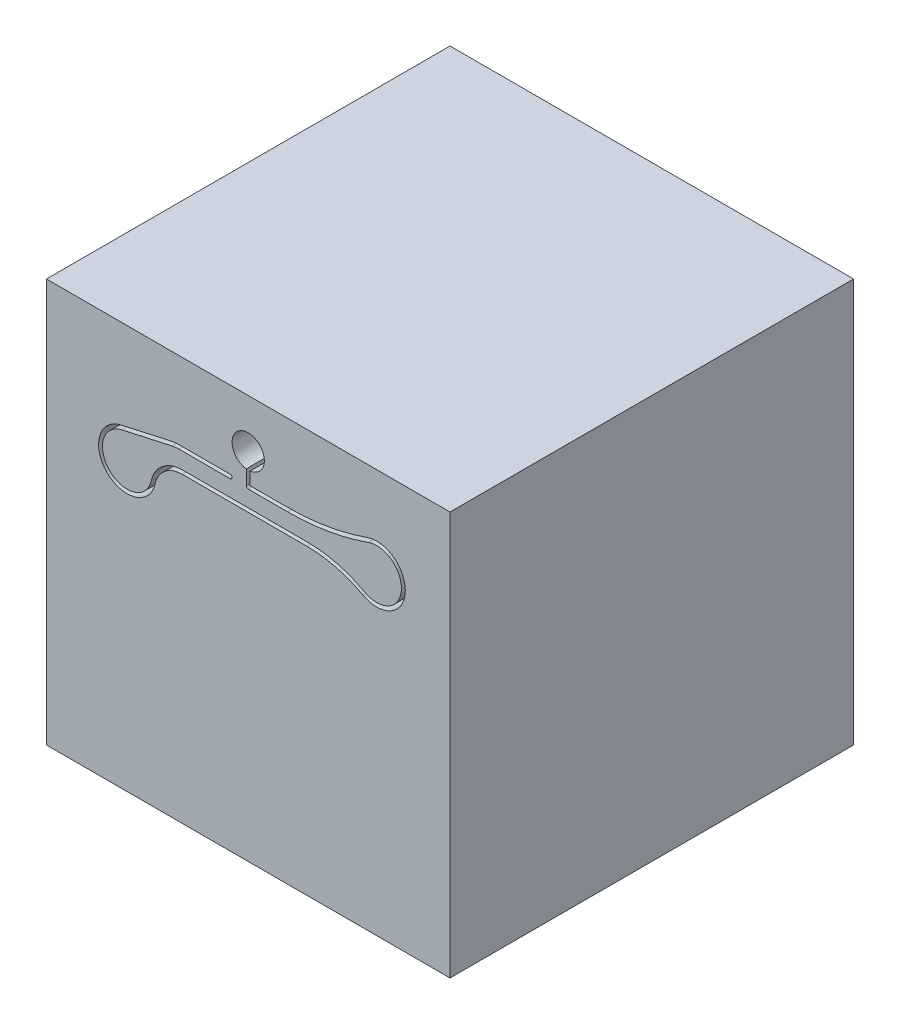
ISO-10303-21;
HEADER;
FILE_DESCRIPTION(('STEP AP214'),'2;1');
FILE_NAME('part.step','',(''),(''),'','','');
FILE_SCHEMA(('AUTOMOTIVE_DESIGN { 1 0 10303 214 1 1 1 1 }'));
ENDSEC;
DATA;
#1=APPLICATION_CONTEXT('core data for automotive mechanical design processes');
#2=APPLICATION_PROTOCOL_DEFINITION('international standard','automotive_design',2000,#1);
#3=PRODUCT_CONTEXT('',#1,'mechanical');
#4=PRODUCT('Part','Part','',(#3));
#5=PRODUCT_RELATED_PRODUCT_CATEGORY('part','',(#4));
#6=PRODUCT_DEFINITION_FORMATION('','',#4);
#7=PRODUCT_DEFINITION_CONTEXT('part definition',#1,'design');
#8=PRODUCT_DEFINITION('design','',#6,#7);
#9=PRODUCT_DEFINITION_SHAPE('','',#8);
#10=(LENGTH_UNIT() NAMED_UNIT(*) SI_UNIT(.MILLI.,.METRE.));
#11=(NAMED_UNIT(*) PLANE_ANGLE_UNIT() SI_UNIT($,.RADIAN.));
#12=(NAMED_UNIT(*) SI_UNIT($,.STERADIAN.) SOLID_ANGLE_UNIT());
#13=UNCERTAINTY_MEASURE_WITH_UNIT(LENGTH_MEASURE(1.E-05),#10,'distance_accuracy_value','');
#14=(GEOMETRIC_REPRESENTATION_CONTEXT(3) GLOBAL_UNCERTAINTY_ASSIGNED_CONTEXT((#13)) GLOBAL_UNIT_ASSIGNED_CONTEXT((#10,
#11,#12)) REPRESENTATION_CONTEXT('',''));
#15=CARTESIAN_POINT('',(0.,0.,0.));
#16=DIRECTION('',(0.,0.,1.));
#17=DIRECTION('',(1.,0.,0.));
#18=AXIS2_PLACEMENT_3D('',#15,#16,#17);
#19=CARTESIAN_POINT('',(16.4135579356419,35.9999999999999,50.));
#20=DIRECTION('',(0.,0.,-1.));
#21=DIRECTION('',(-1.,0.,0.));
#22=AXIS2_PLACEMENT_3D('',#19,#20,#21);
#23=CYLINDRICAL_SURFACE('',#22,4.438);
#24=DIRECTION('',(0.,0.,1.));
#25=VECTOR('',#24,1.);
#26=CARTESIAN_POINT('',(16.4135579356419,40.4379999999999,50.));
#27=LINE('',#26,#25);
#28=CARTESIAN_POINT('',(16.4135579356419,40.4379999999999,0.));
#29=VERTEX_POINT('',#28);
#30=CARTESIAN_POINT('',(16.4135579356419,40.4379999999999,50.));
#31=VERTEX_POINT('',#30);
#32=EDGE_CURVE('E220',#29,#31,#27,.T.);
#33=ORIENTED_EDGE('',*,*,#32,.T.);
#34=CARTESIAN_POINT('',(16.4135579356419,35.9999999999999,50.));
#35=DIRECTION('',(0.,0.,-1.));
#36=DIRECTION('',(-1.,0.,0.));
#37=AXIS2_PLACEMENT_3D('',#34,#35,#36);
#38=CIRCLE('',#37,4.438);
#39=CARTESIAN_POINT('',(15.4529989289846,40.3328016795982,50.));
#40=VERTEX_POINT('',#39);
#41=EDGE_CURVE('E20',#40,#31,#38,.T.);
#42=ORIENTED_EDGE('',*,*,#41,.F.);
#43=DIRECTION('',(0.,0.,1.));
#44=VECTOR('',#43,1.);
#45=CARTESIAN_POINT('',(15.4529989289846,40.3328016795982,50.));
#46=LINE('',#45,#44);
#47=CARTESIAN_POINT('',(15.4529989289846,40.3328016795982,0.));
#48=VERTEX_POINT('',#47);
#49=EDGE_CURVE('E225',#40,#48,#46,.F.);
#50=ORIENTED_EDGE('',*,*,#49,.T.);
#51=CARTESIAN_POINT('',(16.4135579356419,35.9999999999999,0.));
#52=DIRECTION('',(0.,0.,-1.));
#53=DIRECTION('',(-1.,0.,0.));
#54=AXIS2_PLACEMENT_3D('',#51,#52,#53);
#55=CIRCLE('',#54,4.438);
#56=EDGE_CURVE('E218',#29,#48,#55,.F.);
#57=ORIENTED_EDGE('',*,*,#56,.F.);
#58=EDGE_LOOP('',(#33,#42,#50,#57));
#59=FACE_BOUND('',#58,.T.);
#60=ADVANCED_FACE('F17',(#59),#23,.F.);
#61=CARTESIAN_POINT('',(22.761,40.1989999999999,50.));
#62=DIRECTION('',(0.,0.,-1.));
#63=DIRECTION('',(-1.,0.,0.));
#64=AXIS2_PLACEMENT_3D('',#61,#62,#63);
#65=CYLINDRICAL_SURFACE('',#64,0.239000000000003);
#66=DIRECTION('',(0.,0.,-1.));
#67=VECTOR('',#66,1.);
#68=CARTESIAN_POINT('',(22.761,39.9599999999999,50.));
#69=LINE('',#68,#67);
#70=CARTESIAN_POINT('',(22.761,39.9599999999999,0.));
#71=VERTEX_POINT('',#70);
#72=CARTESIAN_POINT('',(22.761,39.9599999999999,50.));
#73=VERTEX_POINT('',#72);
#74=EDGE_CURVE('E283',#71,#73,#69,.F.);
#75=ORIENTED_EDGE('',*,*,#74,.T.);
#76=CARTESIAN_POINT('',(22.761,40.1989999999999,50.));
#77=DIRECTION('',(0.,0.,-1.));
#78=DIRECTION('',(-1.,0.,0.));
#79=AXIS2_PLACEMENT_3D('',#76,#77,#78);
#80=CIRCLE('',#79,0.239000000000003);
#81=CARTESIAN_POINT('',(22.761,40.4379999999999,50.));
#82=VERTEX_POINT('',#81);
#83=EDGE_CURVE('E393',#82,#73,#80,.T.);
#84=ORIENTED_EDGE('',*,*,#83,.F.);
#85=DIRECTION('',(0.,0.,1.));
#86=VECTOR('',#85,1.);
#87=CARTESIAN_POINT('',(22.761,40.4379999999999,50.));
#88=LINE('',#87,#86);
#89=CARTESIAN_POINT('',(22.761,40.4379999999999,0.));
#90=VERTEX_POINT('',#89);
#91=EDGE_CURVE('E224',#82,#90,#88,.F.);
#92=ORIENTED_EDGE('',*,*,#91,.T.);
#93=CARTESIAN_POINT('',(22.761,40.1989999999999,0.));
#94=DIRECTION('',(0.,0.,-1.));
#95=DIRECTION('',(-1.,0.,0.));
#96=AXIS2_PLACEMENT_3D('',#93,#94,#95);
#97=CIRCLE('',#96,0.239000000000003);
#98=EDGE_CURVE('E391',#71,#90,#97,.F.);
#99=ORIENTED_EDGE('',*,*,#98,.F.);
#100=EDGE_LOOP('',(#75,#84,#92,#99));
#101=FACE_BOUND('',#100,.T.);
#102=ADVANCED_FACE('F528',(#101),#65,.F.);
#103=CARTESIAN_POINT('',(16.4135579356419,35.9999999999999,50.));
#104=DIRECTION('',(0.,0.,-1.));
#105=DIRECTION('',(-1.,0.,0.));
#106=AXIS2_PLACEMENT_3D('',#103,#104,#105);
#107=CYLINDRICAL_SURFACE('',#106,3.95999999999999);
#108=CARTESIAN_POINT('',(16.4135579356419,35.9999999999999,50.));
#109=DIRECTION('',(0.,0.,-1.));
#110=DIRECTION('',(-1.,0.,0.));
#111=AXIS2_PLACEMENT_3D('',#108,#109,#110);
#112=CIRCLE('',#111,3.95999999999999);
#113=CARTESIAN_POINT('',(15.556457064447,39.8661321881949,50.));
#114=VERTEX_POINT('',#113);
#115=CARTESIAN_POINT('',(16.4135579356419,39.9599999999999,50.));
#116=VERTEX_POINT('',#115);
#117=EDGE_CURVE('E387',#114,#116,#112,.T.);
#118=ORIENTED_EDGE('',*,*,#117,.T.);
#119=DIRECTION('',(0.,0.,-1.));
#120=VECTOR('',#119,1.);
#121=CARTESIAN_POINT('',(16.4135579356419,39.9599999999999,50.));
#122=LINE('',#121,#120);
#123=CARTESIAN_POINT('',(16.4135579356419,39.9599999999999,0.));
#124=VERTEX_POINT('',#123);
#125=EDGE_CURVE('E282',#116,#124,#122,.T.);
#126=ORIENTED_EDGE('',*,*,#125,.T.);
#127=CARTESIAN_POINT('',(16.4135579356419,35.9999999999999,0.));
#128=DIRECTION('',(0.,0.,-1.));
#129=DIRECTION('',(-1.,0.,0.));
#130=AXIS2_PLACEMENT_3D('',#127,#128,#129);
#131=CIRCLE('',#130,3.95999999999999);
#132=CARTESIAN_POINT('',(15.556457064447,39.8661321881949,0.));
#133=VERTEX_POINT('',#132);
#134=EDGE_CURVE('E389',#124,#133,#131,.F.);
#135=ORIENTED_EDGE('',*,*,#134,.T.);
#136=DIRECTION('',(0.,0.,1.));
#137=VECTOR('',#136,1.);
#138=CARTESIAN_POINT('',(15.556457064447,39.8661321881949,50.));
#139=LINE('',#138,#137);
#140=EDGE_CURVE('E279',#133,#114,#139,.T.);
#141=ORIENTED_EDGE('',*,*,#140,.T.);
#142=EDGE_LOOP('',(#118,#126,#135,#141));
#143=FACE_BOUND('',#142,.T.);
#144=ADVANCED_FACE('F526',(#143),#107,.T.);
#145=CARTESIAN_POINT('',(25.,40.1989999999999,50.));
#146=DIRECTION('',(0.,0.,-1.));
#147=DIRECTION('',(-1.,0.,0.));
#148=AXIS2_PLACEMENT_3D('',#145,#146,#147);
#149=CYLINDRICAL_SURFACE('',#148,0.239000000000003);
#150=DIRECTION('',(0.,0.,1.));
#151=VECTOR('',#150,1.);
#152=CARTESIAN_POINT('',(24.761,40.1989999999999,50.));
#153=LINE('',#152,#151);
#154=CARTESIAN_POINT('',(24.761,40.1989999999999,0.));
#155=VERTEX_POINT('',#154);
#156=CARTESIAN_POINT('',(24.761,40.1989999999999,50.));
#157=VERTEX_POINT('',#156);
#158=EDGE_CURVE('E257',#155,#157,#153,.T.);
#159=ORIENTED_EDGE('',*,*,#158,.T.);
#160=CARTESIAN_POINT('',(25.,40.1989999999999,50.));
#161=DIRECTION('',(0.,0.,-1.));
#162=DIRECTION('',(-1.,0.,0.));
#163=AXIS2_PLACEMENT_3D('',#160,#161,#162);
#164=CIRCLE('',#163,0.239000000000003);
#165=CARTESIAN_POINT('',(25.,39.9599999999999,50.));
#166=VERTEX_POINT('',#165);
#167=EDGE_CURVE('E385',#166,#157,#164,.T.);
#168=ORIENTED_EDGE('',*,*,#167,.F.);
#169=DIRECTION('',(0.,0.,-1.));
#170=VECTOR('',#169,1.);
#171=CARTESIAN_POINT('',(25.,39.9599999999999,50.));
#172=LINE('',#171,#170);
#173=CARTESIAN_POINT('',(25.,39.9599999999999,0.));
#174=VERTEX_POINT('',#173);
#175=EDGE_CURVE('E260',#166,#174,#172,.T.);
#176=ORIENTED_EDGE('',*,*,#175,.T.);
#177=CARTESIAN_POINT('',(25.,40.1989999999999,0.));
#178=DIRECTION('',(0.,0.,-1.));
#179=DIRECTION('',(-1.,0.,0.));
#180=AXIS2_PLACEMENT_3D('',#177,#178,#179);
#181=CIRCLE('',#180,0.239000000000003);
#182=EDGE_CURVE('E315',#155,#174,#181,.F.);
#183=ORIENTED_EDGE('',*,*,#182,.F.);
#184=EDGE_LOOP('',(#159,#168,#176,#183));
#185=FACE_BOUND('',#184,.T.);
#186=ADVANCED_FACE('F468',(#185),#149,.F.);
#187=CARTESIAN_POINT('',(25.239,44.,50.));
#188=DIRECTION('',(1.,0.,0.));
#189=DIRECTION('',(0.,0.,-1.));
#190=AXIS2_PLACEMENT_3D('',#187,#188,#189);
#191=PLANE('',#190);
#192=DIRECTION('',(0.,0.,1.));
#193=VECTOR('',#192,1.);
#194=CARTESIAN_POINT('',(25.239,40.4379999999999,50.));
#195=LINE('',#194,#193);
#196=CARTESIAN_POINT('',(25.239,40.4379999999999,0.));
#197=VERTEX_POINT('',#196);
#198=CARTESIAN_POINT('',(25.239,40.4379999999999,50.));
#199=VERTEX_POINT('',#198);
#200=EDGE_CURVE('E307',#197,#199,#195,.T.);
#201=ORIENTED_EDGE('',*,*,#200,.T.);
#202=DIRECTION('',(0.,1.,0.));
#203=VECTOR('',#202,1.);
#204=CARTESIAN_POINT('',(25.239,44.,50.));
#205=LINE('',#204,#203);
#206=CARTESIAN_POINT('',(25.239,42.0143315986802,50.));
#207=VERTEX_POINT('',#206);
#208=EDGE_CURVE('E313',#207,#199,#205,.F.);
#209=ORIENTED_EDGE('',*,*,#208,.F.);
#210=DIRECTION('',(0.,0.,-1.));
#211=VECTOR('',#210,1.);
#212=CARTESIAN_POINT('',(25.239,42.0143315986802,50.));
#213=LINE('',#212,#211);
#214=CARTESIAN_POINT('',(25.239,42.0143315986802,0.));
#215=VERTEX_POINT('',#214);
#216=EDGE_CURVE('E252',#207,#215,#213,.T.);
#217=ORIENTED_EDGE('',*,*,#216,.T.);
#218=DIRECTION('',(0.,1.,0.));
#219=VECTOR('',#218,1.);
#220=CARTESIAN_POINT('',(25.239,44.,0.));
#221=LINE('',#220,#219);
#222=EDGE_CURVE('E310',#197,#215,#221,.T.);
#223=ORIENTED_EDGE('',*,*,#222,.F.);
#224=EDGE_LOOP('',(#201,#209,#217,#223));
#225=FACE_BOUND('',#224,.T.);
#226=ADVANCED_FACE('F480',(#225),#191,.F.);
#227=CARTESIAN_POINT('',(25.239,40.4379999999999,50.));
#228=DIRECTION('',(0.,1.,0.));
#229=DIRECTION('',(0.,0.,1.));
#230=AXIS2_PLACEMENT_3D('',#227,#228,#229);
#231=PLANE('',#230);
#232=DIRECTION('',(0.,0.,-1.));
#233=VECTOR('',#232,1.);
#234=CARTESIAN_POINT('',(29.8713701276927,40.4379999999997,50.));
#235=LINE('',#234,#233);
#236=CARTESIAN_POINT('',(29.8713701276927,40.4379999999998,50.));
#237=VERTEX_POINT('',#236);
#238=CARTESIAN_POINT('',(29.8713701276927,40.4379999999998,0.));
#239=VERTEX_POINT('',#238);
#240=EDGE_CURVE('E304',#237,#239,#235,.T.);
#241=ORIENTED_EDGE('',*,*,#240,.F.);
#242=DIRECTION('',(1.,0.,0.));
#243=VECTOR('',#242,1.);
#244=CARTESIAN_POINT('',(25.,40.4379999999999,50.));
#245=LINE('',#244,#243);
#246=EDGE_CURVE('E244',#199,#237,#245,.T.);
#247=ORIENTED_EDGE('',*,*,#246,.F.);
#248=ORIENTED_EDGE('',*,*,#200,.F.);
#249=DIRECTION('',(1.,0.,0.));
#250=VECTOR('',#249,1.);
#251=CARTESIAN_POINT('',(25.,40.4379999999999,0.));
#252=LINE('',#251,#250);
#253=EDGE_CURVE('E351',#197,#239,#252,.T.);
#254=ORIENTED_EDGE('',*,*,#253,.T.);
#255=EDGE_LOOP('',(#241,#247,#248,#254));
#256=FACE_BOUND('',#255,.T.);
#257=ADVANCED_FACE('F485',(#256),#231,.F.);
#258=CARTESIAN_POINT('',(29.8713701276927,69.9999999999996,50.));
#259=DIRECTION('',(0.,0.,-1.));
#260=DIRECTION('',(-1.,0.,0.));
#261=AXIS2_PLACEMENT_3D('',#258,#259,#260);
#262=CYLINDRICAL_SURFACE('',#261,29.5619999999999);
#263=CARTESIAN_POINT('',(29.8713701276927,69.9999999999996,50.));
#264=DIRECTION('',(0.,0.,-1.));
#265=DIRECTION('',(-1.,0.,0.));
#266=AXIS2_PLACEMENT_3D('',#263,#264,#265);
#267=CIRCLE('',#266,29.5619999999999);
#268=CARTESIAN_POINT('',(39.7429827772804,42.1349123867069,50.));
#269=VERTEX_POINT('',#268);
#270=EDGE_CURVE('E247',#237,#269,#267,.F.);
#271=ORIENTED_EDGE('',*,*,#270,.F.);
#272=ORIENTED_EDGE('',*,*,#240,.T.);
#273=CARTESIAN_POINT('',(29.8713701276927,69.9999999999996,0.));
#274=DIRECTION('',(0.,0.,-1.));
#275=DIRECTION('',(-1.,0.,0.));
#276=AXIS2_PLACEMENT_3D('',#273,#274,#275);
#277=CIRCLE('',#276,29.5619999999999);
#278=CARTESIAN_POINT('',(39.7429827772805,42.1349123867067,0.));
#279=VERTEX_POINT('',#278);
#280=EDGE_CURVE('E349',#239,#279,#277,.F.);
#281=ORIENTED_EDGE('',*,*,#280,.T.);
#282=DIRECTION('',(0.,0.,-1.));
#283=VECTOR('',#282,1.);
#284=CARTESIAN_POINT('',(39.7429827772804,42.1349123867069,50.));
#285=LINE('',#284,#283);
#286=EDGE_CURVE('E302',#279,#269,#285,.F.);
#287=ORIENTED_EDGE('',*,*,#286,.T.);
#288=EDGE_LOOP('',(#271,#272,#281,#287));
#289=FACE_BOUND('',#288,.T.);
#290=ADVANCED_FACE('F489',(#289),#262,.T.);
#291=CARTESIAN_POINT('',(40.9244240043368,38.7999999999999,50.));
#292=DIRECTION('',(0.,0.,-1.));
#293=DIRECTION('',(-1.,0.,0.));
#294=AXIS2_PLACEMENT_3D('',#291,#292,#293);
#295=CYLINDRICAL_SURFACE('',#294,3.538);
#296=DIRECTION('',(0.,0.,-1.));
#297=VECTOR('',#296,1.);
#298=CARTESIAN_POINT('',(39.233866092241,35.6920331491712,50.));
#299=LINE('',#298,#297);
#300=CARTESIAN_POINT('',(39.233866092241,35.6920331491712,50.));
#301=VERTEX_POINT('',#300);
#302=CARTESIAN_POINT('',(39.233866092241,35.6920331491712,0.));
#303=VERTEX_POINT('',#302);
#304=EDGE_CURVE('E299',#301,#303,#299,.T.);
#305=ORIENTED_EDGE('',*,*,#304,.F.);
#306=CARTESIAN_POINT('',(40.9244240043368,38.7999999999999,50.));
#307=DIRECTION('',(0.,0.,-1.));
#308=DIRECTION('',(-1.,0.,0.));
#309=AXIS2_PLACEMENT_3D('',#306,#307,#308);
#310=CIRCLE('',#309,3.538);
#311=EDGE_CURVE('E379',#269,#301,#310,.T.);
#312=ORIENTED_EDGE('',*,*,#311,.F.);
#313=ORIENTED_EDGE('',*,*,#286,.F.);
#314=CARTESIAN_POINT('',(40.9244240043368,38.7999999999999,0.));
#315=DIRECTION('',(0.,0.,-1.));
#316=DIRECTION('',(-1.,0.,0.));
#317=AXIS2_PLACEMENT_3D('',#314,#315,#316);
#318=CIRCLE('',#317,3.538);
#319=EDGE_CURVE('E347',#279,#303,#318,.T.);
#320=ORIENTED_EDGE('',*,*,#319,.T.);
#321=EDGE_LOOP('',(#305,#312,#313,#320));
#322=FACE_BOUND('',#321,.T.);
#323=ADVANCED_FACE('F494',(#322),#295,.F.);
#324=CARTESIAN_POINT('',(32.275724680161,22.9,50.));
#325=DIRECTION('',(0.,0.,-1.));
#326=DIRECTION('',(-1.,0.,0.));
#327=AXIS2_PLACEMENT_3D('',#324,#325,#326);
#328=CYLINDRICAL_SURFACE('',#327,14.562);
#329=CARTESIAN_POINT('',(32.275724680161,22.9,50.));
#330=DIRECTION('',(0.,0.,-1.));
#331=DIRECTION('',(-1.,0.,0.));
#332=AXIS2_PLACEMENT_3D('',#329,#330,#331);
#333=CIRCLE('',#332,14.562);
#334=CARTESIAN_POINT('',(32.275724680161,37.4619999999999,50.));
#335=VERTEX_POINT('',#334);
#336=EDGE_CURVE('E243',#301,#335,#333,.F.);
#337=ORIENTED_EDGE('',*,*,#336,.F.);
#338=ORIENTED_EDGE('',*,*,#304,.T.);
#339=CARTESIAN_POINT('',(32.275724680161,22.9,0.));
#340=DIRECTION('',(0.,0.,-1.));
#341=DIRECTION('',(-1.,0.,0.));
#342=AXIS2_PLACEMENT_3D('',#339,#340,#341);
#343=CIRCLE('',#342,14.562);
#344=CARTESIAN_POINT('',(32.275724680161,37.4619999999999,0.));
#345=VERTEX_POINT('',#344);
#346=EDGE_CURVE('E345',#303,#345,#343,.F.);
#347=ORIENTED_EDGE('',*,*,#346,.T.);
#348=DIRECTION('',(0.,0.,-1.));
#349=VECTOR('',#348,1.);
#350=CARTESIAN_POINT('',(32.275724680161,37.4619999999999,50.));
#351=LINE('',#350,#349);
#352=EDGE_CURVE('E297',#345,#335,#351,.F.);
#353=ORIENTED_EDGE('',*,*,#352,.T.);
#354=EDGE_LOOP('',(#337,#338,#347,#353));
#355=FACE_BOUND('',#354,.T.);
#356=ADVANCED_FACE('F498',(#355),#328,.T.);
#357=CARTESIAN_POINT('',(32.275724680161,37.4619999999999,50.));
#358=DIRECTION('',(0.,-1.,0.));
#359=DIRECTION('',(0.,0.,-1.));
#360=AXIS2_PLACEMENT_3D('',#357,#358,#359);
#361=PLANE('',#360);
#362=DIRECTION('',(0.,0.,-1.));
#363=VECTOR('',#362,1.);
#364=CARTESIAN_POINT('',(16.8373971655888,37.4619999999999,50.));
#365=LINE('',#364,#363);
#366=CARTESIAN_POINT('',(16.8373971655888,37.4619999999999,50.));
#367=VERTEX_POINT('',#366);
#368=CARTESIAN_POINT('',(16.8373971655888,37.4619999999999,0.));
#369=VERTEX_POINT('',#368);
#370=EDGE_CURVE('E294',#367,#369,#365,.T.);
#371=ORIENTED_EDGE('',*,*,#370,.F.);
#372=DIRECTION('',(1.,0.,0.));
#373=VECTOR('',#372,1.);
#374=CARTESIAN_POINT('',(25.,37.4619999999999,50.));
#375=LINE('',#374,#373);
#376=EDGE_CURVE('E239',#335,#367,#375,.F.);
#377=ORIENTED_EDGE('',*,*,#376,.F.);
#378=ORIENTED_EDGE('',*,*,#352,.F.);
#379=DIRECTION('',(1.,0.,0.));
#380=VECTOR('',#379,1.);
#381=CARTESIAN_POINT('',(25.,37.4619999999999,0.));
#382=LINE('',#381,#380);
#383=EDGE_CURVE('E344',#345,#369,#382,.F.);
#384=ORIENTED_EDGE('',*,*,#383,.T.);
#385=EDGE_LOOP('',(#371,#377,#378,#384));
#386=FACE_BOUND('',#385,.T.);
#387=ADVANCED_FACE('F503',(#386),#361,.F.);
#388=CARTESIAN_POINT('',(16.8373971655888,34.,50.));
#389=DIRECTION('',(0.,0.,-1.));
#390=DIRECTION('',(-1.,0.,0.));
#391=AXIS2_PLACEMENT_3D('',#388,#389,#390);
#392=CYLINDRICAL_SURFACE('',#391,3.46199999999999);
#393=CARTESIAN_POINT('',(16.8373971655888,34.,50.));
#394=DIRECTION('',(0.,0.,-1.));
#395=DIRECTION('',(-1.,0.,0.));
#396=AXIS2_PLACEMENT_3D('',#393,#394,#395);
#397=CIRCLE('',#396,3.46199999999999);
#398=CARTESIAN_POINT('',(13.4558158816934,34.7418571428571,50.));
#399=VERTEX_POINT('',#398);
#400=EDGE_CURVE('E242',#367,#399,#397,.F.);
#401=ORIENTED_EDGE('',*,*,#400,.F.);
#402=ORIENTED_EDGE('',*,*,#370,.T.);
#403=CARTESIAN_POINT('',(16.8373971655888,34.,0.));
#404=DIRECTION('',(0.,0.,-1.));
#405=DIRECTION('',(-1.,0.,0.));
#406=AXIS2_PLACEMENT_3D('',#403,#404,#405);
#407=CIRCLE('',#406,3.46199999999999);
#408=CARTESIAN_POINT('',(13.4558158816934,34.7418571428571,0.));
#409=VERTEX_POINT('',#408);
#410=EDGE_CURVE('E342',#369,#409,#407,.F.);
#411=ORIENTED_EDGE('',*,*,#410,.T.);
#412=DIRECTION('',(0.,0.,-1.));
#413=VECTOR('',#412,1.);
#414=CARTESIAN_POINT('',(13.4558158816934,34.7418571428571,50.));
#415=LINE('',#414,#413);
#416=EDGE_CURVE('E291',#409,#399,#415,.F.);
#417=ORIENTED_EDGE('',*,*,#416,.T.);
#418=EDGE_LOOP('',(#401,#402,#411,#417));
#419=FACE_BOUND('',#418,.T.);
#420=ADVANCED_FACE('F507',(#419),#392,.T.);
#421=CARTESIAN_POINT('',(10.0000000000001,35.5,50.));
#422=DIRECTION('',(0.,0.,-1.));
#423=DIRECTION('',(-1.,0.,0.));
#424=AXIS2_PLACEMENT_3D('',#421,#422,#423);
#425=CYLINDRICAL_SURFACE('',#424,3.538);
#426=DIRECTION('',(0.,0.,1.));
#427=VECTOR('',#426,1.);
#428=CARTESIAN_POINT('',(9.23423664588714,38.9541352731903,50.));
#429=LINE('',#428,#427);
#430=CARTESIAN_POINT('',(9.23423664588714,38.9541352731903,0.));
#431=VERTEX_POINT('',#430);
#432=CARTESIAN_POINT('',(9.23423664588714,38.9541352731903,50.));
#433=VERTEX_POINT('',#432);
#434=EDGE_CURVE('E289',#431,#433,#429,.T.);
#435=ORIENTED_EDGE('',*,*,#434,.T.);
#436=CARTESIAN_POINT('',(10.0000000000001,35.5,50.));
#437=DIRECTION('',(0.,0.,-1.));
#438=DIRECTION('',(-1.,0.,0.));
#439=AXIS2_PLACEMENT_3D('',#436,#437,#438);
#440=CIRCLE('',#439,3.538);
#441=EDGE_CURVE('E235',#399,#433,#440,.T.);
#442=ORIENTED_EDGE('',*,*,#441,.F.);
#443=ORIENTED_EDGE('',*,*,#416,.F.);
#444=CARTESIAN_POINT('',(10.0000000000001,35.5,0.));
#445=DIRECTION('',(0.,0.,-1.));
#446=DIRECTION('',(-1.,0.,0.));
#447=AXIS2_PLACEMENT_3D('',#444,#445,#446);
#448=CIRCLE('',#447,3.538);
#449=EDGE_CURVE('E339',#409,#431,#448,.T.);
#450=ORIENTED_EDGE('',*,*,#449,.T.);
#451=EDGE_LOOP('',(#435,#442,#443,#450));
#452=FACE_BOUND('',#451,.T.);
#453=ADVANCED_FACE('F511',(#452),#425,.F.);
#454=CARTESIAN_POINT('',(9.23423664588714,38.9541352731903,50.));
#455=DIRECTION('',(-0.216439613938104,0.976296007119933,0.));
#456=DIRECTION('',(-0.976296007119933,-0.216439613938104,0.));
#457=AXIS2_PLACEMENT_3D('',#454,#455,#456);
#458=PLANE('',#457);
#459=ORIENTED_EDGE('',*,*,#49,.F.);
#460=DIRECTION('',(0.976296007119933,0.216439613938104,0.));
#461=VECTOR('',#460,1.);
#462=CARTESIAN_POINT('',(9.23423664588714,38.9541352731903,50.));
#463=LINE('',#462,#461);
#464=EDGE_CURVE('E217',#433,#40,#463,.T.);
#465=ORIENTED_EDGE('',*,*,#464,.F.);
#466=ORIENTED_EDGE('',*,*,#434,.F.);
#467=DIRECTION('',(0.976296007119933,0.216439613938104,0.));
#468=VECTOR('',#467,1.);
#469=CARTESIAN_POINT('',(9.23423664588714,38.9541352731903,0.));
#470=LINE('',#469,#468);
#471=EDGE_CURVE('E341',#431,#48,#470,.T.);
#472=ORIENTED_EDGE('',*,*,#471,.T.);
#473=EDGE_LOOP('',(#459,#465,#466,#472));
#474=FACE_BOUND('',#473,.T.);
#475=ADVANCED_FACE('F403',(#474),#458,.F.);
#476=CARTESIAN_POINT('',(16.4135579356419,40.4379999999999,50.));
#477=DIRECTION('',(0.,1.,0.));
#478=DIRECTION('',(0.,0.,1.));
#479=AXIS2_PLACEMENT_3D('',#476,#477,#478);
#480=PLANE('',#479);
#481=ORIENTED_EDGE('',*,*,#91,.F.);
#482=DIRECTION('',(1.,0.,0.));
#483=VECTOR('',#482,1.);
#484=CARTESIAN_POINT('',(25.,40.4379999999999,50.));
#485=LINE('',#484,#483);
#486=EDGE_CURVE('E214',#31,#82,#485,.T.);
#487=ORIENTED_EDGE('',*,*,#486,.F.);
#488=ORIENTED_EDGE('',*,*,#32,.F.);
#489=DIRECTION('',(1.,0.,0.));
#490=VECTOR('',#489,1.);
#491=CARTESIAN_POINT('',(25.,40.4379999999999,0.));
#492=LINE('',#491,#490);
#493=EDGE_CURVE('E400',#29,#90,#492,.T.);
#494=ORIENTED_EDGE('',*,*,#493,.T.);
#495=EDGE_LOOP('',(#481,#487,#488,#494));
#496=FACE_BOUND('',#495,.T.);
#497=ADVANCED_FACE('F228',(#496),#480,.F.);
#498=CARTESIAN_POINT('',(22.761,39.9599999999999,50.));
#499=DIRECTION('',(0.,-1.,0.));
#500=DIRECTION('',(0.,0.,-1.));
#501=AXIS2_PLACEMENT_3D('',#498,#499,#500);
#502=PLANE('',#501);
#503=ORIENTED_EDGE('',*,*,#125,.F.);
#504=DIRECTION('',(1.,0.,0.));
#505=VECTOR('',#504,1.);
#506=CARTESIAN_POINT('',(25.,39.9599999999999,50.));
#507=LINE('',#506,#505);
#508=EDGE_CURVE('E230',#73,#116,#507,.F.);
#509=ORIENTED_EDGE('',*,*,#508,.F.);
#510=ORIENTED_EDGE('',*,*,#74,.F.);
#511=DIRECTION('',(1.,0.,0.));
#512=VECTOR('',#511,1.);
#513=CARTESIAN_POINT('',(25.,39.9599999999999,0.));
#514=LINE('',#513,#512);
#515=EDGE_CURVE('E405',#71,#124,#514,.F.);
#516=ORIENTED_EDGE('',*,*,#515,.T.);
#517=EDGE_LOOP('',(#503,#509,#510,#516));
#518=FACE_BOUND('',#517,.T.);
#519=ADVANCED_FACE('F523',(#518),#502,.F.);
#520=CARTESIAN_POINT('',(15.556457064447,39.8661321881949,50.));
#521=DIRECTION('',(0.216439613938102,-0.976296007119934,0.));
#522=DIRECTION('',(0.976296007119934,0.216439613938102,0.));
#523=AXIS2_PLACEMENT_3D('',#520,#521,#522);
#524=PLANE('',#523);
#525=DIRECTION('',(0.,0.,-1.));
#526=VECTOR('',#525,1.);
#527=CARTESIAN_POINT('',(9.33769478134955,38.4874657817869,50.));
#528=LINE('',#527,#526);
#529=CARTESIAN_POINT('',(9.33769478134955,38.4874657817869,50.));
#530=VERTEX_POINT('',#529);
#531=CARTESIAN_POINT('',(9.33769478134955,38.4874657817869,0.));
#532=VERTEX_POINT('',#531);
#533=EDGE_CURVE('E276',#530,#532,#528,.T.);
#534=ORIENTED_EDGE('',*,*,#533,.F.);
#535=DIRECTION('',(-0.976296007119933,-0.216439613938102,0.));
#536=VECTOR('',#535,1.);
#537=CARTESIAN_POINT('',(15.556457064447,39.8661321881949,50.));
#538=LINE('',#537,#536);
#539=EDGE_CURVE('E233',#114,#530,#538,.T.);
#540=ORIENTED_EDGE('',*,*,#539,.F.);
#541=ORIENTED_EDGE('',*,*,#140,.F.);
#542=DIRECTION('',(-0.976296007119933,-0.216439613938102,0.));
#543=VECTOR('',#542,1.);
#544=CARTESIAN_POINT('',(15.556457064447,39.8661321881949,0.));
#545=LINE('',#544,#543);
#546=EDGE_CURVE('E338',#133,#532,#545,.T.);
#547=ORIENTED_EDGE('',*,*,#546,.T.);
#548=EDGE_LOOP('',(#534,#540,#541,#547));
#549=FACE_BOUND('',#548,.T.);
#550=ADVANCED_FACE('F431',(#549),#524,.F.);
#551=CARTESIAN_POINT('',(10.0000000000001,35.5,50.));
#552=DIRECTION('',(0.,0.,-1.));
#553=DIRECTION('',(-1.,0.,0.));
#554=AXIS2_PLACEMENT_3D('',#551,#552,#553);
#555=CYLINDRICAL_SURFACE('',#554,3.06);
#556=CARTESIAN_POINT('',(10.0000000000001,35.5,50.));
#557=DIRECTION('',(0.,0.,-1.));
#558=DIRECTION('',(-1.,0.,0.));
#559=AXIS2_PLACEMENT_3D('',#556,#557,#558);
#560=CIRCLE('',#559,3.06);
#561=CARTESIAN_POINT('',(12.988919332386,34.8442857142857,50.));
#562=VERTEX_POINT('',#561);
#563=EDGE_CURVE('E371',#530,#562,#560,.F.);
#564=ORIENTED_EDGE('',*,*,#563,.F.);
#565=ORIENTED_EDGE('',*,*,#533,.T.);
#566=CARTESIAN_POINT('',(10.0000000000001,35.5,0.));
#567=DIRECTION('',(0.,0.,-1.));
#568=DIRECTION('',(-1.,0.,0.));
#569=AXIS2_PLACEMENT_3D('',#566,#567,#568);
#570=CIRCLE('',#569,3.06);
#571=CARTESIAN_POINT('',(12.988919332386,34.8442857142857,0.));
#572=VERTEX_POINT('',#571);
#573=EDGE_CURVE('E336',#532,#572,#570,.F.);
#574=ORIENTED_EDGE('',*,*,#573,.T.);
#575=DIRECTION('',(0.,0.,-1.));
#576=VECTOR('',#575,1.);
#577=CARTESIAN_POINT('',(12.988919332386,34.8442857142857,50.));
#578=LINE('',#577,#576);
#579=EDGE_CURVE('E274',#572,#562,#578,.F.);
#580=ORIENTED_EDGE('',*,*,#579,.T.);
#581=EDGE_LOOP('',(#564,#565,#574,#580));
#582=FACE_BOUND('',#581,.T.);
#583=ADVANCED_FACE('F435',(#582),#555,.T.);
#584=CARTESIAN_POINT('',(16.8373971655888,34.,50.));
#585=DIRECTION('',(0.,0.,-1.));
#586=DIRECTION('',(-1.,0.,0.));
#587=AXIS2_PLACEMENT_3D('',#584,#585,#586);
#588=CYLINDRICAL_SURFACE('',#587,3.93999999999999);
#589=DIRECTION('',(0.,0.,1.));
#590=VECTOR('',#589,1.);
#591=CARTESIAN_POINT('',(16.8373971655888,37.9399999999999,50.));
#592=LINE('',#591,#590);
#593=CARTESIAN_POINT('',(16.8373971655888,37.9399999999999,0.));
#594=VERTEX_POINT('',#593);
#595=CARTESIAN_POINT('',(16.8373971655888,37.9399999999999,50.));
#596=VERTEX_POINT('',#595);
#597=EDGE_CURVE('E272',#594,#596,#592,.T.);
#598=ORIENTED_EDGE('',*,*,#597,.T.);
#599=CARTESIAN_POINT('',(16.8373971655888,34.,50.));
#600=DIRECTION('',(0.,0.,-1.));
#601=DIRECTION('',(-1.,0.,0.));
#602=AXIS2_PLACEMENT_3D('',#599,#600,#601);
#603=CIRCLE('',#602,3.93999999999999);
#604=EDGE_CURVE('E368',#562,#596,#603,.T.);
#605=ORIENTED_EDGE('',*,*,#604,.F.);
#606=ORIENTED_EDGE('',*,*,#579,.F.);
#607=CARTESIAN_POINT('',(16.8373971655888,34.,0.));
#608=DIRECTION('',(0.,0.,-1.));
#609=DIRECTION('',(-1.,0.,0.));
#610=AXIS2_PLACEMENT_3D('',#607,#608,#609);
#611=CIRCLE('',#610,3.93999999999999);
#612=EDGE_CURVE('E334',#572,#594,#611,.T.);
#613=ORIENTED_EDGE('',*,*,#612,.T.);
#614=EDGE_LOOP('',(#598,#605,#606,#613));
#615=FACE_BOUND('',#614,.T.);
#616=ADVANCED_FACE('F440',(#615),#588,.F.);
#617=CARTESIAN_POINT('',(16.8373971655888,37.9399999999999,50.));
#618=DIRECTION('',(0.,1.,0.));
#619=DIRECTION('',(0.,0.,1.));
#620=AXIS2_PLACEMENT_3D('',#617,#618,#619);
#621=PLANE('',#620);
#622=DIRECTION('',(0.,0.,-1.));
#623=VECTOR('',#622,1.);
#624=CARTESIAN_POINT('',(32.275724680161,37.9399999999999,50.));
#625=LINE('',#624,#623);
#626=CARTESIAN_POINT('',(32.275724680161,37.9399999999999,0.));
#627=VERTEX_POINT('',#626);
#628=CARTESIAN_POINT('',(32.275724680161,37.9399999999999,50.));
#629=VERTEX_POINT('',#628);
#630=EDGE_CURVE('E270',#627,#629,#625,.F.);
#631=ORIENTED_EDGE('',*,*,#630,.T.);
#632=DIRECTION('',(1.,0.,0.));
#633=VECTOR('',#632,1.);
#634=CARTESIAN_POINT('',(25.,37.9399999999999,50.));
#635=LINE('',#634,#633);
#636=EDGE_CURVE('E367',#596,#629,#635,.T.);
#637=ORIENTED_EDGE('',*,*,#636,.F.);
#638=ORIENTED_EDGE('',*,*,#597,.F.);
#639=DIRECTION('',(1.,0.,0.));
#640=VECTOR('',#639,1.);
#641=CARTESIAN_POINT('',(25.,37.9399999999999,0.));
#642=LINE('',#641,#640);
#643=EDGE_CURVE('E333',#594,#627,#642,.T.);
#644=ORIENTED_EDGE('',*,*,#643,.T.);
#645=EDGE_LOOP('',(#631,#637,#638,#644));
#646=FACE_BOUND('',#645,.T.);
#647=ADVANCED_FACE('F445',(#646),#621,.F.);
#648=CARTESIAN_POINT('',(32.275724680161,22.9,50.));
#649=DIRECTION('',(0.,0.,-1.));
#650=DIRECTION('',(-1.,0.,0.));
#651=AXIS2_PLACEMENT_3D('',#648,#649,#650);
#652=CYLINDRICAL_SURFACE('',#651,15.04);
#653=DIRECTION('',(0.,0.,-1.));
#654=VECTOR('',#653,1.);
#655=CARTESIAN_POINT('',(39.46226820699,36.1119337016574,50.));
#656=LINE('',#655,#654);
#657=CARTESIAN_POINT('',(39.46226820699,36.1119337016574,50.));
#658=VERTEX_POINT('',#657);
#659=CARTESIAN_POINT('',(39.46226820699,36.1119337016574,0.));
#660=VERTEX_POINT('',#659);
#661=EDGE_CURVE('E267',#658,#660,#656,.T.);
#662=ORIENTED_EDGE('',*,*,#661,.F.);
#663=CARTESIAN_POINT('',(32.275724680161,22.9,50.));
#664=DIRECTION('',(0.,0.,-1.));
#665=DIRECTION('',(-1.,0.,0.));
#666=AXIS2_PLACEMENT_3D('',#663,#664,#665);
#667=CIRCLE('',#666,15.04);
#668=EDGE_CURVE('E364',#629,#658,#667,.T.);
#669=ORIENTED_EDGE('',*,*,#668,.F.);
#670=ORIENTED_EDGE('',*,*,#630,.F.);
#671=CARTESIAN_POINT('',(32.275724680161,22.9,0.));
#672=DIRECTION('',(0.,0.,-1.));
#673=DIRECTION('',(-1.,0.,0.));
#674=AXIS2_PLACEMENT_3D('',#671,#672,#673);
#675=CIRCLE('',#674,15.04);
#676=EDGE_CURVE('E331',#627,#660,#675,.T.);
#677=ORIENTED_EDGE('',*,*,#676,.T.);
#678=EDGE_LOOP('',(#662,#669,#670,#677));
#679=FACE_BOUND('',#678,.T.);
#680=ADVANCED_FACE('F450',(#679),#652,.F.);
#681=CARTESIAN_POINT('',(40.9244240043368,38.7999999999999,50.));
#682=DIRECTION('',(0.,0.,-1.));
#683=DIRECTION('',(-1.,0.,0.));
#684=AXIS2_PLACEMENT_3D('',#681,#682,#683);
#685=CYLINDRICAL_SURFACE('',#684,3.05999999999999);
#686=CARTESIAN_POINT('',(40.9244240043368,38.7999999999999,50.));
#687=DIRECTION('',(0.,0.,-1.));
#688=DIRECTION('',(-1.,0.,0.));
#689=AXIS2_PLACEMENT_3D('',#686,#687,#688);
#690=CIRCLE('',#689,3.05999999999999);
#691=CARTESIAN_POINT('',(39.9026008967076,41.6843504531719,50.));
#692=VERTEX_POINT('',#691);
#693=EDGE_CURVE('E361',#658,#692,#690,.F.);
#694=ORIENTED_EDGE('',*,*,#693,.F.);
#695=ORIENTED_EDGE('',*,*,#661,.T.);
#696=CARTESIAN_POINT('',(40.9244240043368,38.7999999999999,0.));
#697=DIRECTION('',(0.,0.,-1.));
#698=DIRECTION('',(-1.,0.,0.));
#699=AXIS2_PLACEMENT_3D('',#696,#697,#698);
#700=CIRCLE('',#699,3.05999999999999);
#701=CARTESIAN_POINT('',(39.9026008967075,41.684350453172,0.));
#702=VERTEX_POINT('',#701);
#703=EDGE_CURVE('E329',#660,#702,#700,.F.);
#704=ORIENTED_EDGE('',*,*,#703,.T.);
#705=DIRECTION('',(0.,0.,-1.));
#706=VECTOR('',#705,1.);
#707=CARTESIAN_POINT('',(39.9026008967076,41.6843504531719,50.));
#708=LINE('',#707,#706);
#709=EDGE_CURVE('E263',#702,#692,#708,.F.);
#710=ORIENTED_EDGE('',*,*,#709,.T.);
#711=EDGE_LOOP('',(#694,#695,#704,#710));
#712=FACE_BOUND('',#711,.T.);
#713=ADVANCED_FACE('F454',(#712),#685,.T.);
#714=CARTESIAN_POINT('',(29.8713701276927,69.9999999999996,50.));
#715=DIRECTION('',(0.,0.,-1.));
#716=DIRECTION('',(-1.,0.,0.));
#717=AXIS2_PLACEMENT_3D('',#714,#715,#716);
#718=CYLINDRICAL_SURFACE('',#717,30.0399999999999);
#719=DIRECTION('',(0.,0.,-1.));
#720=VECTOR('',#719,1.);
#721=CARTESIAN_POINT('',(29.8713701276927,39.9599999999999,50.));
#722=LINE('',#721,#720);
#723=CARTESIAN_POINT('',(29.8713701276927,39.9599999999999,0.));
#724=VERTEX_POINT('',#723);
#725=CARTESIAN_POINT('',(29.8713701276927,39.9599999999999,50.));
#726=VERTEX_POINT('',#725);
#727=EDGE_CURVE('E261',#724,#726,#722,.F.);
#728=ORIENTED_EDGE('',*,*,#727,.T.);
#729=CARTESIAN_POINT('',(29.8713701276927,69.9999999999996,50.));
#730=DIRECTION('',(0.,0.,-1.));
#731=DIRECTION('',(-1.,0.,0.));
#732=AXIS2_PLACEMENT_3D('',#729,#730,#731);
#733=CIRCLE('',#732,30.0399999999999);
#734=EDGE_CURVE('E357',#692,#726,#733,.T.);
#735=ORIENTED_EDGE('',*,*,#734,.F.);
#736=ORIENTED_EDGE('',*,*,#709,.F.);
#737=CARTESIAN_POINT('',(29.8713701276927,69.9999999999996,0.));
#738=DIRECTION('',(0.,0.,-1.));
#739=DIRECTION('',(-1.,0.,0.));
#740=AXIS2_PLACEMENT_3D('',#737,#738,#739);
#741=CIRCLE('',#740,30.0399999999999);
#742=EDGE_CURVE('E326',#702,#724,#741,.T.);
#743=ORIENTED_EDGE('',*,*,#742,.T.);
#744=EDGE_LOOP('',(#728,#735,#736,#743));
#745=FACE_BOUND('',#744,.T.);
#746=ADVANCED_FACE('F459',(#745),#718,.F.);
#747=CARTESIAN_POINT('',(29.8713701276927,39.9599999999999,50.));
#748=DIRECTION('',(0.,-1.,0.));
#749=DIRECTION('',(0.,0.,-1.));
#750=AXIS2_PLACEMENT_3D('',#747,#748,#749);
#751=PLANE('',#750);
#752=ORIENTED_EDGE('',*,*,#175,.F.);
#753=DIRECTION('',(1.,0.,0.));
#754=VECTOR('',#753,1.);
#755=CARTESIAN_POINT('',(25.,39.9599999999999,50.));
#756=LINE('',#755,#754);
#757=EDGE_CURVE('E360',#726,#166,#756,.F.);
#758=ORIENTED_EDGE('',*,*,#757,.F.);
#759=ORIENTED_EDGE('',*,*,#727,.F.);
#760=DIRECTION('',(1.,0.,0.));
#761=VECTOR('',#760,1.);
#762=CARTESIAN_POINT('',(25.,39.9599999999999,0.));
#763=LINE('',#762,#761);
#764=EDGE_CURVE('E328',#724,#174,#763,.F.);
#765=ORIENTED_EDGE('',*,*,#764,.T.);
#766=EDGE_LOOP('',(#752,#758,#759,#765));
#767=FACE_BOUND('',#766,.T.);
#768=ADVANCED_FACE('F466',(#767),#751,.F.);
#769=CARTESIAN_POINT('',(24.761,40.1989999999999,50.));
#770=DIRECTION('',(-1.,0.,0.));
#771=DIRECTION('',(0.,0.,1.));
#772=AXIS2_PLACEMENT_3D('',#769,#770,#771);
#773=PLANE('',#772);
#774=DIRECTION('',(0.,0.,-1.));
#775=VECTOR('',#774,1.);
#776=CARTESIAN_POINT('',(24.761,42.0143315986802,50.));
#777=LINE('',#776,#775);
#778=CARTESIAN_POINT('',(24.761,42.0143315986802,0.));
#779=VERTEX_POINT('',#778);
#780=CARTESIAN_POINT('',(24.761,42.0143315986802,50.));
#781=VERTEX_POINT('',#780);
#782=EDGE_CURVE('E255',#779,#781,#777,.F.);
#783=ORIENTED_EDGE('',*,*,#782,.T.);
#784=DIRECTION('',(0.,1.,0.));
#785=VECTOR('',#784,1.);
#786=CARTESIAN_POINT('',(24.761,25.,50.));
#787=LINE('',#786,#785);
#788=EDGE_CURVE('E356',#157,#781,#787,.T.);
#789=ORIENTED_EDGE('',*,*,#788,.F.);
#790=ORIENTED_EDGE('',*,*,#158,.F.);
#791=DIRECTION('',(0.,1.,0.));
#792=VECTOR('',#791,1.);
#793=CARTESIAN_POINT('',(24.761,25.,0.));
#794=LINE('',#793,#792);
#795=EDGE_CURVE('E325',#155,#779,#794,.T.);
#796=ORIENTED_EDGE('',*,*,#795,.T.);
#797=EDGE_LOOP('',(#783,#789,#790,#796));
#798=FACE_BOUND('',#797,.T.);
#799=ADVANCED_FACE('F473',(#798),#773,.F.);
#800=CARTESIAN_POINT('',(25.,44.,50.));
#801=DIRECTION('',(0.,0.,-1.));
#802=DIRECTION('',(-1.,0.,0.));
#803=AXIS2_PLACEMENT_3D('',#800,#801,#802);
#804=CYLINDRICAL_SURFACE('',#803,2.);
#805=CARTESIAN_POINT('',(25.,44.,50.));
#806=DIRECTION('',(0.,0.,-1.));
#807=DIRECTION('',(-1.,0.,0.));
#808=AXIS2_PLACEMENT_3D('',#805,#806,#807);
#809=CIRCLE('',#808,2.);
#810=EDGE_CURVE('E352',#781,#207,#809,.T.);
#811=ORIENTED_EDGE('',*,*,#810,.F.);
#812=ORIENTED_EDGE('',*,*,#782,.F.);
#813=CARTESIAN_POINT('',(25.,44.,0.));
#814=DIRECTION('',(0.,0.,-1.));
#815=DIRECTION('',(-1.,0.,0.));
#816=AXIS2_PLACEMENT_3D('',#813,#814,#815);
#817=CIRCLE('',#816,2.);
#818=EDGE_CURVE('E321',#779,#215,#817,.T.);
#819=ORIENTED_EDGE('',*,*,#818,.T.);
#820=ORIENTED_EDGE('',*,*,#216,.F.);
#821=EDGE_LOOP('',(#811,#812,#819,#820));
#822=FACE_BOUND('',#821,.T.);
#823=ADVANCED_FACE('F478',(#822),#804,.F.);
#824=CARTESIAN_POINT('',(0.,50.,0.));
#825=DIRECTION('',(0.,1.,0.));
#826=DIRECTION('',(0.,0.,1.));
#827=AXIS2_PLACEMENT_3D('',#824,#825,#826);
#828=PLANE('',#827);
#829=DIRECTION('',(1.,0.,0.));
#830=VECTOR('',#829,1.);
#831=CARTESIAN_POINT('',(25.,50.,0.));
#832=LINE('',#831,#830);
#833=CARTESIAN_POINT('',(50.,50.,0.));
#834=VERTEX_POINT('',#833);
#835=CARTESIAN_POINT('',(0.,50.,0.));
#836=VERTEX_POINT('',#835);
#837=EDGE_CURVE('E411',#834,#836,#832,.F.);
#838=ORIENTED_EDGE('',*,*,#837,.T.);
#839=DIRECTION('',(0.,0.,1.));
#840=VECTOR('',#839,1.);
#841=CARTESIAN_POINT('',(0.,50.,0.));
#842=LINE('',#841,#840);
#843=CARTESIAN_POINT('',(0.,50.,50.));
#844=VERTEX_POINT('',#843);
#845=EDGE_CURVE('E418',#844,#836,#842,.F.);
#846=ORIENTED_EDGE('',*,*,#845,.F.);
#847=DIRECTION('',(1.,0.,0.));
#848=VECTOR('',#847,1.);
#849=CARTESIAN_POINT('',(25.,50.,50.));
#850=LINE('',#849,#848);
#851=CARTESIAN_POINT('',(50.,50.,50.));
#852=VERTEX_POINT('',#851);
#853=EDGE_CURVE('E248',#852,#844,#850,.F.);
#854=ORIENTED_EDGE('',*,*,#853,.F.);
#855=DIRECTION('',(0.,0.,-1.));
#856=VECTOR('',#855,1.);
#857=CARTESIAN_POINT('',(50.,50.,0.));
#858=LINE('',#857,#856);
#859=EDGE_CURVE('E732',#834,#852,#858,.F.);
#860=ORIENTED_EDGE('',*,*,#859,.F.);
#861=EDGE_LOOP('',(#838,#846,#854,#860));
#862=FACE_BOUND('',#861,.T.);
#863=ADVANCED_FACE('F557',(#862),#828,.T.);
#864=CARTESIAN_POINT('',(25.,25.,50.));
#865=DIRECTION('',(0.,0.,1.));
#866=DIRECTION('',(1.,0.,0.));
#867=AXIS2_PLACEMENT_3D('',#864,#865,#866);
#868=PLANE('',#867);
#869=ORIENTED_EDGE('',*,*,#788,.T.);
#870=ORIENTED_EDGE('',*,*,#810,.T.);
#871=ORIENTED_EDGE('',*,*,#208,.T.);
#872=ORIENTED_EDGE('',*,*,#246,.T.);
#873=ORIENTED_EDGE('',*,*,#270,.T.);
#874=ORIENTED_EDGE('',*,*,#311,.T.);
#875=ORIENTED_EDGE('',*,*,#336,.T.);
#876=ORIENTED_EDGE('',*,*,#376,.T.);
#877=ORIENTED_EDGE('',*,*,#400,.T.);
#878=ORIENTED_EDGE('',*,*,#441,.T.);
#879=ORIENTED_EDGE('',*,*,#464,.T.);
#880=ORIENTED_EDGE('',*,*,#41,.T.);
#881=ORIENTED_EDGE('',*,*,#486,.T.);
#882=ORIENTED_EDGE('',*,*,#83,.T.);
#883=ORIENTED_EDGE('',*,*,#508,.T.);
#884=ORIENTED_EDGE('',*,*,#117,.F.);
#885=ORIENTED_EDGE('',*,*,#539,.T.);
#886=ORIENTED_EDGE('',*,*,#563,.T.);
#887=ORIENTED_EDGE('',*,*,#604,.T.);
#888=ORIENTED_EDGE('',*,*,#636,.T.);
#889=ORIENTED_EDGE('',*,*,#668,.T.);
#890=ORIENTED_EDGE('',*,*,#693,.T.);
#891=ORIENTED_EDGE('',*,*,#734,.T.);
#892=ORIENTED_EDGE('',*,*,#757,.T.);
#893=ORIENTED_EDGE('',*,*,#167,.T.);
#894=EDGE_LOOP('',(#869,#870,#871,#872,#873,#874,#875,#876,#877,#878,#879,#880,#881,#882,#883,
#884,#885,#886,#887,#888,#889,#890,#891,#892,#893));
#895=FACE_BOUND('',#894,.T.);
#896=DIRECTION('',(0.,1.,0.));
#897=VECTOR('',#896,1.);
#898=CARTESIAN_POINT('',(0.,0.,50.));
#899=LINE('',#898,#897);
#900=CARTESIAN_POINT('',(0.,0.,50.));
#901=VERTEX_POINT('',#900);
#902=EDGE_CURVE('E355',#901,#844,#899,.T.);
#903=ORIENTED_EDGE('',*,*,#902,.F.);
#904=DIRECTION('',(1.,0.,0.));
#905=VECTOR('',#904,1.);
#906=CARTESIAN_POINT('',(50.,0.,50.));
#907=LINE('',#906,#905);
#908=CARTESIAN_POINT('',(50.,0.,50.));
#909=VERTEX_POINT('',#908);
#910=EDGE_CURVE('E738',#909,#901,#907,.F.);
#911=ORIENTED_EDGE('',*,*,#910,.F.);
#912=DIRECTION('',(0.,1.,0.));
#913=VECTOR('',#912,1.);
#914=CARTESIAN_POINT('',(50.,50.,50.));
#915=LINE('',#914,#913);
#916=EDGE_CURVE('E324',#852,#909,#915,.F.);
#917=ORIENTED_EDGE('',*,*,#916,.F.);
#918=ORIENTED_EDGE('',*,*,#853,.T.);
#919=EDGE_LOOP('',(#903,#911,#917,#918));
#920=FACE_BOUND('',#919,.T.);
#921=ADVANCED_FACE('F211',(#895,#920),#868,.T.);
#922=CARTESIAN_POINT('',(0.,0.,0.));
#923=DIRECTION('',(-1.,0.,0.));
#924=DIRECTION('',(0.,0.,1.));
#925=AXIS2_PLACEMENT_3D('',#922,#923,#924);
#926=PLANE('',#925);
#927=DIRECTION('',(0.,1.,0.));
#928=VECTOR('',#927,1.);
#929=CARTESIAN_POINT('',(0.,25.,0.));
#930=LINE('',#929,#928);
#931=CARTESIAN_POINT('',(0.,0.,0.));
#932=VERTEX_POINT('',#931);
#933=EDGE_CURVE('E416',#836,#932,#930,.F.);
#934=ORIENTED_EDGE('',*,*,#933,.T.);
#935=DIRECTION('',(0.,0.,-1.));
#936=VECTOR('',#935,1.);
#937=CARTESIAN_POINT('',(0.,0.,0.));
#938=LINE('',#937,#936);
#939=EDGE_CURVE('E735',#901,#932,#938,.T.);
#940=ORIENTED_EDGE('',*,*,#939,.F.);
#941=ORIENTED_EDGE('',*,*,#902,.T.);
#942=ORIENTED_EDGE('',*,*,#845,.T.);
#943=EDGE_LOOP('',(#934,#940,#941,#942));
#944=FACE_BOUND('',#943,.T.);
#945=ADVANCED_FACE('F551',(#944),#926,.T.);
#946=CARTESIAN_POINT('',(25.,25.,0.));
#947=DIRECTION('',(0.,0.,1.));
#948=DIRECTION('',(1.,0.,0.));
#949=AXIS2_PLACEMENT_3D('',#946,#947,#948);
#950=PLANE('',#949);
#951=ORIENTED_EDGE('',*,*,#818,.F.);
#952=ORIENTED_EDGE('',*,*,#795,.F.);
#953=ORIENTED_EDGE('',*,*,#182,.T.);
#954=ORIENTED_EDGE('',*,*,#764,.F.);
#955=ORIENTED_EDGE('',*,*,#742,.F.);
#956=ORIENTED_EDGE('',*,*,#703,.F.);
#957=ORIENTED_EDGE('',*,*,#676,.F.);
#958=ORIENTED_EDGE('',*,*,#643,.F.);
#959=ORIENTED_EDGE('',*,*,#612,.F.);
#960=ORIENTED_EDGE('',*,*,#573,.F.);
#961=ORIENTED_EDGE('',*,*,#546,.F.);
#962=ORIENTED_EDGE('',*,*,#134,.F.);
#963=ORIENTED_EDGE('',*,*,#515,.F.);
#964=ORIENTED_EDGE('',*,*,#98,.T.);
#965=ORIENTED_EDGE('',*,*,#493,.F.);
#966=ORIENTED_EDGE('',*,*,#56,.T.);
#967=ORIENTED_EDGE('',*,*,#471,.F.);
#968=ORIENTED_EDGE('',*,*,#449,.F.);
#969=ORIENTED_EDGE('',*,*,#410,.F.);
#970=ORIENTED_EDGE('',*,*,#383,.F.);
#971=ORIENTED_EDGE('',*,*,#346,.F.);
#972=ORIENTED_EDGE('',*,*,#319,.F.);
#973=ORIENTED_EDGE('',*,*,#280,.F.);
#974=ORIENTED_EDGE('',*,*,#253,.F.);
#975=ORIENTED_EDGE('',*,*,#222,.T.);
#976=EDGE_LOOP('',(#951,#952,#953,#954,#955,#956,#957,#958,#959,#960,#961,#962,#963,#964,#965,
#966,#967,#968,#969,#970,#971,#972,#973,#974,#975));
#977=FACE_BOUND('',#976,.T.);
#978=DIRECTION('',(0.,1.,0.));
#979=VECTOR('',#978,1.);
#980=CARTESIAN_POINT('',(50.,50.,0.));
#981=LINE('',#980,#979);
#982=CARTESIAN_POINT('',(50.,0.,0.));
#983=VERTEX_POINT('',#982);
#984=EDGE_CURVE('E35',#983,#834,#981,.T.);
#985=ORIENTED_EDGE('',*,*,#984,.F.);
#986=DIRECTION('',(1.,0.,0.));
#987=VECTOR('',#986,1.);
#988=CARTESIAN_POINT('',(50.,0.,0.));
#989=LINE('',#988,#987);
#990=EDGE_CURVE('E26',#932,#983,#989,.T.);
#991=ORIENTED_EDGE('',*,*,#990,.F.);
#992=ORIENTED_EDGE('',*,*,#933,.F.);
#993=ORIENTED_EDGE('',*,*,#837,.F.);
#994=EDGE_LOOP('',(#985,#991,#992,#993));
#995=FACE_BOUND('',#994,.T.);
#996=ADVANCED_FACE('F397',(#977,#995),#950,.F.);
#997=CARTESIAN_POINT('',(50.,50.,0.));
#998=DIRECTION('',(1.,0.,0.));
#999=DIRECTION('',(0.,0.,-1.));
#1000=AXIS2_PLACEMENT_3D('',#997,#998,#999);
#1001=PLANE('',#1000);
#1002=ORIENTED_EDGE('',*,*,#984,.T.);
#1003=ORIENTED_EDGE('',*,*,#859,.T.);
#1004=ORIENTED_EDGE('',*,*,#916,.T.);
#1005=DIRECTION('',(0.,0.,-1.));
#1006=VECTOR('',#1005,1.);
#1007=CARTESIAN_POINT('',(50.,0.,0.));
#1008=LINE('',#1007,#1006);
#1009=EDGE_CURVE('E11',#983,#909,#1008,.F.);
#1010=ORIENTED_EDGE('',*,*,#1009,.F.);
#1011=EDGE_LOOP('',(#1002,#1003,#1004,#1010));
#1012=FACE_BOUND('',#1011,.T.);
#1013=ADVANCED_FACE('F539',(#1012),#1001,.T.);
#1014=CARTESIAN_POINT('',(50.,0.,0.));
#1015=DIRECTION('',(0.,-1.,0.));
#1016=DIRECTION('',(0.,0.,-1.));
#1017=AXIS2_PLACEMENT_3D('',#1014,#1015,#1016);
#1018=PLANE('',#1017);
#1019=ORIENTED_EDGE('',*,*,#990,.T.);
#1020=ORIENTED_EDGE('',*,*,#1009,.T.);
#1021=ORIENTED_EDGE('',*,*,#910,.T.);
#1022=ORIENTED_EDGE('',*,*,#939,.T.);
#1023=EDGE_LOOP('',(#1019,#1020,#1021,#1022));
#1024=FACE_BOUND('',#1023,.T.);
#1025=ADVANCED_FACE('F537',(#1024),#1018,.T.);
#1026=CLOSED_SHELL('',(#60,#102,#144,#186,#226,#257,#290,#323,#356,#387,#420,#453,#475,#497,
#519,#550,#583,#616,#647,#680,#713,#746,#768,#799,#823,#863,#921,#945,#996,#1013,#1025));
#1027=MANIFOLD_SOLID_BREP('B1',#1026);
#1028=ADVANCED_BREP_SHAPE_REPRESENTATION('',(#18,#1027),#14);
#1029=SHAPE_DEFINITION_REPRESENTATION(#9,#1028);
ENDSEC;
END-ISO-10303-21;
